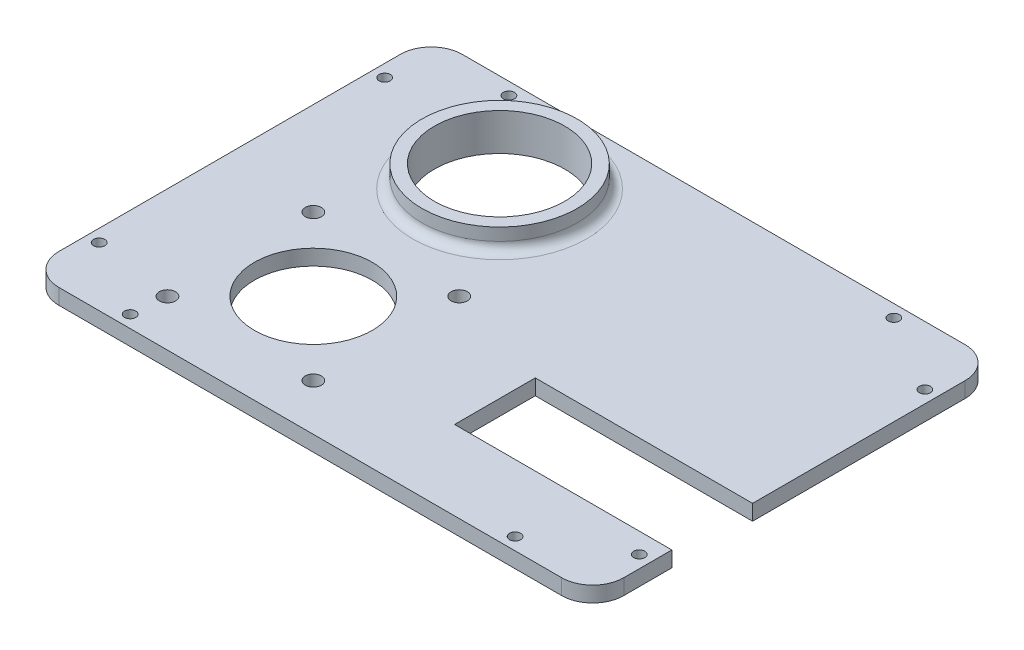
ISO-10303-21;
HEADER;
FILE_DESCRIPTION(('STEP AP214'),'2;1');
FILE_NAME('part.step','',(''),(''),'','','');
FILE_SCHEMA(('AUTOMOTIVE_DESIGN { 1 0 10303 214 1 1 1 1 }'));
ENDSEC;
DATA;
#1=APPLICATION_CONTEXT('core data for automotive mechanical design processes');
#2=APPLICATION_PROTOCOL_DEFINITION('international standard','automotive_design',2000,#1);
#3=PRODUCT_CONTEXT('',#1,'mechanical');
#4=PRODUCT('Part','Part','',(#3));
#5=PRODUCT_RELATED_PRODUCT_CATEGORY('part','',(#4));
#6=PRODUCT_DEFINITION_FORMATION('','',#4);
#7=PRODUCT_DEFINITION_CONTEXT('part definition',#1,'design');
#8=PRODUCT_DEFINITION('design','',#6,#7);
#9=PRODUCT_DEFINITION_SHAPE('','',#8);
#10=(LENGTH_UNIT() NAMED_UNIT(*) SI_UNIT(.MILLI.,.METRE.));
#11=(NAMED_UNIT(*) PLANE_ANGLE_UNIT() SI_UNIT($,.RADIAN.));
#12=(NAMED_UNIT(*) SI_UNIT($,.STERADIAN.) SOLID_ANGLE_UNIT());
#13=UNCERTAINTY_MEASURE_WITH_UNIT(LENGTH_MEASURE(1.E-05),#10,'distance_accuracy_value','');
#14=(GEOMETRIC_REPRESENTATION_CONTEXT(3) GLOBAL_UNCERTAINTY_ASSIGNED_CONTEXT((#13)) GLOBAL_UNIT_ASSIGNED_CONTEXT((#10,
#11,#12)) REPRESENTATION_CONTEXT('',''));
#15=CARTESIAN_POINT('',(0.,0.,0.));
#16=DIRECTION('',(0.,0.,1.));
#17=DIRECTION('',(1.,0.,0.));
#18=AXIS2_PLACEMENT_3D('',#15,#16,#17);
#19=CARTESIAN_POINT('',(0.,5.,0.));
#20=DIRECTION('',(0.,1.,0.));
#21=DIRECTION('',(0.,0.,1.));
#22=AXIS2_PLACEMENT_3D('',#19,#20,#21);
#23=PLANE('',#22);
#24=CARTESIAN_POINT('',(99.5000000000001,5.,34.5));
#25=DIRECTION('',(0.,1.,0.));
#26=DIRECTION('',(0.,0.,-1.));
#27=AXIS2_PLACEMENT_3D('',#24,#25,#26);
#28=CIRCLE('',#27,1.80000000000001);
#29=CARTESIAN_POINT('',(99.5000000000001,5.,32.7));
#30=VERTEX_POINT('',#29);
#31=EDGE_CURVE('E616',#30,#30,#28,.T.);
#32=ORIENTED_EDGE('',*,*,#31,.F.);
#33=EDGE_LOOP('',(#32));
#34=FACE_BOUND('',#33,.T.);
#35=CARTESIAN_POINT('',(-49.5,5.,-72.5));
#36=DIRECTION('',(0.,1.,0.));
#37=DIRECTION('',(0.,0.,-1.));
#38=AXIS2_PLACEMENT_3D('',#35,#36,#37);
#39=CIRCLE('',#38,1.8);
#40=CARTESIAN_POINT('',(-49.5,5.,-74.3));
#41=VERTEX_POINT('',#40);
#42=EDGE_CURVE('E622',#41,#41,#39,.T.);
#43=ORIENTED_EDGE('',*,*,#42,.F.);
#44=EDGE_LOOP('',(#43));
#45=FACE_BOUND('',#44,.T.);
#46=CARTESIAN_POINT('',(-24.5,5.,-87.5));
#47=DIRECTION('',(0.,1.,0.));
#48=DIRECTION('',(0.,0.,-1.));
#49=AXIS2_PLACEMENT_3D('',#46,#47,#48);
#50=CIRCLE('',#49,1.80000000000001);
#51=CARTESIAN_POINT('',(-24.5,5.,-89.3));
#52=VERTEX_POINT('',#51);
#53=EDGE_CURVE('E641',#52,#52,#50,.T.);
#54=ORIENTED_EDGE('',*,*,#53,.F.);
#55=EDGE_LOOP('',(#54));
#56=FACE_BOUND('',#55,.T.);
#57=CARTESIAN_POINT('',(-24.5,5.,34.5));
#58=DIRECTION('',(0.,1.,0.));
#59=DIRECTION('',(0.,0.,1.));
#60=AXIS2_PLACEMENT_3D('',#57,#58,#59);
#61=CIRCLE('',#60,1.80000000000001);
#62=CARTESIAN_POINT('',(-24.5,5.,36.3));
#63=VERTEX_POINT('',#62);
#64=EDGE_CURVE('E633',#63,#63,#61,.T.);
#65=ORIENTED_EDGE('',*,*,#64,.F.);
#66=EDGE_LOOP('',(#65));
#67=FACE_BOUND('',#66,.T.);
#68=CARTESIAN_POINT('',(124.5,5.,19.5));
#69=DIRECTION('',(0.,1.,0.));
#70=DIRECTION('',(0.,0.,-1.));
#71=AXIS2_PLACEMENT_3D('',#68,#69,#70);
#72=CIRCLE('',#71,1.80000000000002);
#73=CARTESIAN_POINT('',(124.5,5.,17.7));
#74=VERTEX_POINT('',#73);
#75=EDGE_CURVE('E625',#74,#74,#72,.T.);
#76=ORIENTED_EDGE('',*,*,#75,.F.);
#77=EDGE_LOOP('',(#76));
#78=FACE_BOUND('',#77,.T.);
#79=CARTESIAN_POINT('',(124.5,5.,-72.5));
#80=DIRECTION('',(0.,1.,0.));
#81=DIRECTION('',(0.,0.,1.));
#82=AXIS2_PLACEMENT_3D('',#79,#80,#81);
#83=CIRCLE('',#82,1.80000000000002);
#84=CARTESIAN_POINT('',(124.5,5.,-70.7));
#85=VERTEX_POINT('',#84);
#86=EDGE_CURVE('E663',#85,#85,#83,.T.);
#87=ORIENTED_EDGE('',*,*,#86,.F.);
#88=EDGE_LOOP('',(#87));
#89=FACE_BOUND('',#88,.T.);
#90=CARTESIAN_POINT('',(99.5000000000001,5.,-87.5));
#91=DIRECTION('',(0.,1.,0.));
#92=DIRECTION('',(0.,0.,1.));
#93=AXIS2_PLACEMENT_3D('',#90,#91,#92);
#94=CIRCLE('',#93,1.80000000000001);
#95=CARTESIAN_POINT('',(99.5000000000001,5.,-85.7));
#96=VERTEX_POINT('',#95);
#97=EDGE_CURVE('E655',#96,#96,#94,.T.);
#98=ORIENTED_EDGE('',*,*,#97,.F.);
#99=EDGE_LOOP('',(#98));
#100=FACE_BOUND('',#99,.T.);
#101=CARTESIAN_POINT('',(-49.5,5.,19.5));
#102=DIRECTION('',(0.,1.,0.));
#103=DIRECTION('',(0.,0.,1.));
#104=AXIS2_PLACEMENT_3D('',#101,#102,#103);
#105=CIRCLE('',#104,1.8);
#106=CARTESIAN_POINT('',(-49.5,5.,21.3));
#107=VERTEX_POINT('',#106);
#108=EDGE_CURVE('E391',#107,#107,#105,.T.);
#109=ORIENTED_EDGE('',*,*,#108,.F.);
#110=EDGE_LOOP('',(#109));
#111=FACE_BOUND('',#110,.T.);
#112=CARTESIAN_POINT('',(0.,5.,-60.));
#113=DIRECTION('',(0.,1.,0.));
#114=DIRECTION('',(0.,0.,1.));
#115=AXIS2_PLACEMENT_3D('',#112,#113,#114);
#116=CIRCLE('',#115,28.);
#117=CARTESIAN_POINT('',(0.,5.,-32.));
#118=VERTEX_POINT('',#117);
#119=EDGE_CURVE('E11',#118,#118,#116,.F.);
#120=ORIENTED_EDGE('',*,*,#119,.T.);
#121=EDGE_LOOP('',(#120));
#122=FACE_BOUND('',#121,.T.);
#123=CARTESIAN_POINT('',(-23.5,5.,-23.5));
#124=DIRECTION('',(0.,1.,0.));
#125=DIRECTION('',(0.,0.,1.));
#126=AXIS2_PLACEMENT_3D('',#123,#124,#125);
#127=CIRCLE('',#126,2.59999999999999);
#128=CARTESIAN_POINT('',(-23.5,5.,-20.9));
#129=VERTEX_POINT('',#128);
#130=EDGE_CURVE('E181',#129,#129,#127,.T.);
#131=ORIENTED_EDGE('',*,*,#130,.F.);
#132=EDGE_LOOP('',(#131));
#133=FACE_BOUND('',#132,.T.);
#134=CARTESIAN_POINT('',(23.5,5.,-23.5));
#135=DIRECTION('',(0.,1.,0.));
#136=DIRECTION('',(0.,0.,1.));
#137=AXIS2_PLACEMENT_3D('',#134,#135,#136);
#138=CIRCLE('',#137,2.59999999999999);
#139=CARTESIAN_POINT('',(23.5,5.,-20.9));
#140=VERTEX_POINT('',#139);
#141=EDGE_CURVE('E177',#140,#140,#138,.T.);
#142=ORIENTED_EDGE('',*,*,#141,.F.);
#143=EDGE_LOOP('',(#142));
#144=FACE_BOUND('',#143,.T.);
#145=CARTESIAN_POINT('',(23.5,5.,23.5));
#146=DIRECTION('',(0.,1.,0.));
#147=DIRECTION('',(0.,0.,1.));
#148=AXIS2_PLACEMENT_3D('',#145,#146,#147);
#149=CIRCLE('',#148,2.59999999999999);
#150=CARTESIAN_POINT('',(23.5,5.,26.1));
#151=VERTEX_POINT('',#150);
#152=EDGE_CURVE('E173',#151,#151,#149,.T.);
#153=ORIENTED_EDGE('',*,*,#152,.F.);
#154=EDGE_LOOP('',(#153));
#155=FACE_BOUND('',#154,.T.);
#156=CARTESIAN_POINT('',(-23.5,5.,23.5));
#157=DIRECTION('',(0.,1.,0.));
#158=DIRECTION('',(0.,0.,1.));
#159=AXIS2_PLACEMENT_3D('',#156,#157,#158);
#160=CIRCLE('',#159,2.59999999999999);
#161=CARTESIAN_POINT('',(-23.5,5.,26.1));
#162=VERTEX_POINT('',#161);
#163=EDGE_CURVE('E169',#162,#162,#160,.T.);
#164=ORIENTED_EDGE('',*,*,#163,.F.);
#165=EDGE_LOOP('',(#164));
#166=FACE_BOUND('',#165,.T.);
#167=CARTESIAN_POINT('',(0.,5.,0.));
#168=DIRECTION('',(0.,1.,0.));
#169=DIRECTION('',(0.,0.,1.));
#170=AXIS2_PLACEMENT_3D('',#167,#168,#169);
#171=CIRCLE('',#170,19.);
#172=CARTESIAN_POINT('',(0.,5.,19.));
#173=VERTEX_POINT('',#172);
#174=EDGE_CURVE('E162',#173,#173,#171,.T.);
#175=ORIENTED_EDGE('',*,*,#174,.F.);
#176=EDGE_LOOP('',(#175));
#177=FACE_BOUND('',#176,.T.);
#178=DIRECTION('',(0.,0.,1.));
#179=VECTOR('',#178,1.);
#180=CARTESIAN_POINT('',(-53.5,5.,0.));
#181=LINE('',#180,#179);
#182=CARTESIAN_POINT('',(-53.5,5.,-81.5));
#183=VERTEX_POINT('',#182);
#184=CARTESIAN_POINT('',(-53.5,5.,28.5));
#185=VERTEX_POINT('',#184);
#186=EDGE_CURVE('E249',#183,#185,#181,.T.);
#187=ORIENTED_EDGE('',*,*,#186,.T.);
#188=CARTESIAN_POINT('',(-43.5,5.,28.5));
#189=DIRECTION('',(0.,1.,0.));
#190=DIRECTION('',(0.,0.,1.));
#191=AXIS2_PLACEMENT_3D('',#188,#189,#190);
#192=CIRCLE('',#191,9.99999999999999);
#193=CARTESIAN_POINT('',(-43.5,5.,38.5));
#194=VERTEX_POINT('',#193);
#195=EDGE_CURVE('E111',#185,#194,#192,.T.);
#196=ORIENTED_EDGE('',*,*,#195,.T.);
#197=DIRECTION('',(1.,0.,0.));
#198=VECTOR('',#197,1.);
#199=CARTESIAN_POINT('',(0.,5.,38.5));
#200=LINE('',#199,#198);
#201=CARTESIAN_POINT('',(118.5,5.,38.5));
#202=VERTEX_POINT('',#201);
#203=EDGE_CURVE('E399',#194,#202,#200,.T.);
#204=ORIENTED_EDGE('',*,*,#203,.T.);
#205=CARTESIAN_POINT('',(118.5,5.,28.5));
#206=DIRECTION('',(0.,1.,0.));
#207=DIRECTION('',(0.,0.,1.));
#208=AXIS2_PLACEMENT_3D('',#205,#206,#207);
#209=CIRCLE('',#208,9.99999999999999);
#210=CARTESIAN_POINT('',(128.5,5.,28.5));
#211=VERTEX_POINT('',#210);
#212=EDGE_CURVE('E402',#202,#211,#209,.T.);
#213=ORIENTED_EDGE('',*,*,#212,.T.);
#214=DIRECTION('',(0.,0.,1.));
#215=VECTOR('',#214,1.);
#216=CARTESIAN_POINT('',(128.5,5.,0.));
#217=LINE('',#216,#215);
#218=CARTESIAN_POINT('',(128.5,5.,13.));
#219=VERTEX_POINT('',#218);
#220=EDGE_CURVE('E405',#219,#211,#217,.T.);
#221=ORIENTED_EDGE('',*,*,#220,.F.);
#222=DIRECTION('',(1.,0.,0.));
#223=VECTOR('',#222,1.);
#224=CARTESIAN_POINT('',(0.,5.,13.));
#225=LINE('',#224,#223);
#226=CARTESIAN_POINT('',(58.5,5.,13.));
#227=VERTEX_POINT('',#226);
#228=EDGE_CURVE('E409',#227,#219,#225,.T.);
#229=ORIENTED_EDGE('',*,*,#228,.F.);
#230=DIRECTION('',(0.,0.,1.));
#231=VECTOR('',#230,1.);
#232=CARTESIAN_POINT('',(58.5,5.,0.));
#233=LINE('',#232,#231);
#234=CARTESIAN_POINT('',(58.5,5.,-13.));
#235=VERTEX_POINT('',#234);
#236=EDGE_CURVE('E413',#235,#227,#233,.T.);
#237=ORIENTED_EDGE('',*,*,#236,.F.);
#238=DIRECTION('',(-1.,0.,0.));
#239=VECTOR('',#238,1.);
#240=CARTESIAN_POINT('',(0.,5.,-13.));
#241=LINE('',#240,#239);
#242=CARTESIAN_POINT('',(128.5,5.,-13.));
#243=VERTEX_POINT('',#242);
#244=EDGE_CURVE('E416',#243,#235,#241,.T.);
#245=ORIENTED_EDGE('',*,*,#244,.F.);
#246=CARTESIAN_POINT('',(128.5,5.,-81.5));
#247=VERTEX_POINT('',#246);
#248=EDGE_CURVE('E155',#247,#243,#217,.T.);
#249=ORIENTED_EDGE('',*,*,#248,.F.);
#250=CARTESIAN_POINT('',(118.5,5.,-81.5));
#251=DIRECTION('',(0.,1.,0.));
#252=DIRECTION('',(0.,0.,1.));
#253=AXIS2_PLACEMENT_3D('',#250,#251,#252);
#254=CIRCLE('',#253,9.99999999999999);
#255=CARTESIAN_POINT('',(118.5,5.,-91.5));
#256=VERTEX_POINT('',#255);
#257=EDGE_CURVE('E141',#256,#247,#254,.F.);
#258=ORIENTED_EDGE('',*,*,#257,.F.);
#259=DIRECTION('',(1.,0.,0.));
#260=VECTOR('',#259,1.);
#261=CARTESIAN_POINT('',(0.,5.,-91.5));
#262=LINE('',#261,#260);
#263=CARTESIAN_POINT('',(-43.5,5.,-91.5));
#264=VERTEX_POINT('',#263);
#265=EDGE_CURVE('E152',#264,#256,#262,.T.);
#266=ORIENTED_EDGE('',*,*,#265,.F.);
#267=CARTESIAN_POINT('',(-43.5,5.,-81.5));
#268=DIRECTION('',(0.,1.,0.));
#269=DIRECTION('',(0.,0.,1.));
#270=AXIS2_PLACEMENT_3D('',#267,#268,#269);
#271=CIRCLE('',#270,9.99999999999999);
#272=EDGE_CURVE('E59',#264,#183,#271,.T.);
#273=ORIENTED_EDGE('',*,*,#272,.T.);
#274=EDGE_LOOP('',(#187,#196,#204,#213,#221,#229,#237,#245,#249,#258,#266,#273));
#275=FACE_BOUND('',#274,.T.);
#276=ADVANCED_FACE('F41',(#34,#45,#56,#67,#78,#89,#100,#111,#122,#133,#144,#155,#166,#177,#275),
#23,.T.);
#277=CARTESIAN_POINT('',(-53.5,5.,0.));
#278=DIRECTION('',(1.,0.,0.));
#279=DIRECTION('',(0.,0.,-1.));
#280=AXIS2_PLACEMENT_3D('',#277,#278,#279);
#281=PLANE('',#280);
#282=DIRECTION('',(0.,0.,1.));
#283=VECTOR('',#282,1.);
#284=CARTESIAN_POINT('',(-53.5,0.,0.));
#285=LINE('',#284,#283);
#286=CARTESIAN_POINT('',(-53.5,0.,-81.5));
#287=VERTEX_POINT('',#286);
#288=CARTESIAN_POINT('',(-53.5,0.,28.5));
#289=VERTEX_POINT('',#288);
#290=EDGE_CURVE('E190',#287,#289,#285,.T.);
#291=ORIENTED_EDGE('',*,*,#290,.T.);
#292=DIRECTION('',(0.,-1.,0.));
#293=VECTOR('',#292,1.);
#294=CARTESIAN_POINT('',(-53.5,5.,28.5));
#295=LINE('',#294,#293);
#296=EDGE_CURVE('E279',#185,#289,#295,.T.);
#297=ORIENTED_EDGE('',*,*,#296,.F.);
#298=ORIENTED_EDGE('',*,*,#186,.F.);
#299=DIRECTION('',(0.,-1.,0.));
#300=VECTOR('',#299,1.);
#301=CARTESIAN_POINT('',(-53.5,5.,-81.5));
#302=LINE('',#301,#300);
#303=EDGE_CURVE('E185',#183,#287,#302,.T.);
#304=ORIENTED_EDGE('',*,*,#303,.T.);
#305=EDGE_LOOP('',(#291,#297,#298,#304));
#306=FACE_BOUND('',#305,.T.);
#307=ADVANCED_FACE('F302',(#306),#281,.F.);
#308=CARTESIAN_POINT('',(-43.5,5.,28.5));
#309=DIRECTION('',(0.,-1.,0.));
#310=DIRECTION('',(0.,0.,-1.));
#311=AXIS2_PLACEMENT_3D('',#308,#309,#310);
#312=CYLINDRICAL_SURFACE('',#311,9.99999999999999);
#313=CARTESIAN_POINT('',(-43.5,0.,28.5));
#314=DIRECTION('',(0.,1.,0.));
#315=DIRECTION('',(0.,0.,1.));
#316=AXIS2_PLACEMENT_3D('',#313,#314,#315);
#317=CIRCLE('',#316,9.99999999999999);
#318=CARTESIAN_POINT('',(-43.5,0.,38.5));
#319=VERTEX_POINT('',#318);
#320=EDGE_CURVE('E195',#289,#319,#317,.T.);
#321=ORIENTED_EDGE('',*,*,#320,.T.);
#322=DIRECTION('',(0.,-1.,0.));
#323=VECTOR('',#322,1.);
#324=CARTESIAN_POINT('',(-43.5,5.,38.5));
#325=LINE('',#324,#323);
#326=EDGE_CURVE('E275',#194,#319,#325,.T.);
#327=ORIENTED_EDGE('',*,*,#326,.F.);
#328=ORIENTED_EDGE('',*,*,#195,.F.);
#329=ORIENTED_EDGE('',*,*,#296,.T.);
#330=EDGE_LOOP('',(#321,#327,#328,#329));
#331=FACE_BOUND('',#330,.T.);
#332=ADVANCED_FACE('F308',(#331),#312,.T.);
#333=CARTESIAN_POINT('',(0.,5.,38.5));
#334=DIRECTION('',(0.,0.,-1.));
#335=DIRECTION('',(-1.,0.,0.));
#336=AXIS2_PLACEMENT_3D('',#333,#334,#335);
#337=PLANE('',#336);
#338=DIRECTION('',(1.,0.,0.));
#339=VECTOR('',#338,1.);
#340=CARTESIAN_POINT('',(0.,0.,38.5));
#341=LINE('',#340,#339);
#342=CARTESIAN_POINT('',(118.5,0.,38.5));
#343=VERTEX_POINT('',#342);
#344=EDGE_CURVE('E198',#319,#343,#341,.T.);
#345=ORIENTED_EDGE('',*,*,#344,.T.);
#346=DIRECTION('',(0.,-1.,0.));
#347=VECTOR('',#346,1.);
#348=CARTESIAN_POINT('',(118.5,5.,38.5));
#349=LINE('',#348,#347);
#350=EDGE_CURVE('E271',#202,#343,#349,.T.);
#351=ORIENTED_EDGE('',*,*,#350,.F.);
#352=ORIENTED_EDGE('',*,*,#203,.F.);
#353=ORIENTED_EDGE('',*,*,#326,.T.);
#354=EDGE_LOOP('',(#345,#351,#352,#353));
#355=FACE_BOUND('',#354,.T.);
#356=ADVANCED_FACE('F367',(#355),#337,.F.);
#357=CARTESIAN_POINT('',(118.5,5.,28.5));
#358=DIRECTION('',(0.,-1.,0.));
#359=DIRECTION('',(0.,0.,-1.));
#360=AXIS2_PLACEMENT_3D('',#357,#358,#359);
#361=CYLINDRICAL_SURFACE('',#360,9.99999999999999);
#362=CARTESIAN_POINT('',(118.5,0.,28.5));
#363=DIRECTION('',(0.,1.,0.));
#364=DIRECTION('',(0.,0.,1.));
#365=AXIS2_PLACEMENT_3D('',#362,#363,#364);
#366=CIRCLE('',#365,9.99999999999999);
#367=CARTESIAN_POINT('',(128.5,0.,28.5));
#368=VERTEX_POINT('',#367);
#369=EDGE_CURVE('E201',#343,#368,#366,.T.);
#370=ORIENTED_EDGE('',*,*,#369,.T.);
#371=DIRECTION('',(0.,-1.,0.));
#372=VECTOR('',#371,1.);
#373=CARTESIAN_POINT('',(128.5,5.,28.5));
#374=LINE('',#373,#372);
#375=EDGE_CURVE('E268',#211,#368,#374,.T.);
#376=ORIENTED_EDGE('',*,*,#375,.F.);
#377=ORIENTED_EDGE('',*,*,#212,.F.);
#378=ORIENTED_EDGE('',*,*,#350,.T.);
#379=EDGE_LOOP('',(#370,#376,#377,#378));
#380=FACE_BOUND('',#379,.T.);
#381=ADVANCED_FACE('F364',(#380),#361,.T.);
#382=CARTESIAN_POINT('',(128.5,5.,0.));
#383=DIRECTION('',(1.,0.,0.));
#384=DIRECTION('',(0.,0.,-1.));
#385=AXIS2_PLACEMENT_3D('',#382,#383,#384);
#386=PLANE('',#385);
#387=DIRECTION('',(0.,0.,1.));
#388=VECTOR('',#387,1.);
#389=CARTESIAN_POINT('',(128.5,0.,0.));
#390=LINE('',#389,#388);
#391=CARTESIAN_POINT('',(128.5,0.,13.));
#392=VERTEX_POINT('',#391);
#393=EDGE_CURVE('E205',#392,#368,#390,.T.);
#394=ORIENTED_EDGE('',*,*,#393,.F.);
#395=DIRECTION('',(0.,-1.,0.));
#396=VECTOR('',#395,1.);
#397=CARTESIAN_POINT('',(128.5,5.,13.));
#398=LINE('',#397,#396);
#399=EDGE_CURVE('E265',#219,#392,#398,.T.);
#400=ORIENTED_EDGE('',*,*,#399,.F.);
#401=ORIENTED_EDGE('',*,*,#220,.T.);
#402=ORIENTED_EDGE('',*,*,#375,.T.);
#403=EDGE_LOOP('',(#394,#400,#401,#402));
#404=FACE_BOUND('',#403,.T.);
#405=ADVANCED_FACE('F352',(#404),#386,.T.);
#406=CARTESIAN_POINT('',(0.,5.,13.));
#407=DIRECTION('',(0.,0.,-1.));
#408=DIRECTION('',(-1.,0.,0.));
#409=AXIS2_PLACEMENT_3D('',#406,#407,#408);
#410=PLANE('',#409);
#411=DIRECTION('',(1.,0.,0.));
#412=VECTOR('',#411,1.);
#413=CARTESIAN_POINT('',(0.,0.,13.));
#414=LINE('',#413,#412);
#415=CARTESIAN_POINT('',(58.5,0.,13.));
#416=VERTEX_POINT('',#415);
#417=EDGE_CURVE('E209',#416,#392,#414,.T.);
#418=ORIENTED_EDGE('',*,*,#417,.F.);
#419=DIRECTION('',(0.,-1.,0.));
#420=VECTOR('',#419,1.);
#421=CARTESIAN_POINT('',(58.5,5.,13.));
#422=LINE('',#421,#420);
#423=EDGE_CURVE('E262',#227,#416,#422,.T.);
#424=ORIENTED_EDGE('',*,*,#423,.F.);
#425=ORIENTED_EDGE('',*,*,#228,.T.);
#426=ORIENTED_EDGE('',*,*,#399,.T.);
#427=EDGE_LOOP('',(#418,#424,#425,#426));
#428=FACE_BOUND('',#427,.T.);
#429=ADVANCED_FACE('F359',(#428),#410,.T.);
#430=CARTESIAN_POINT('',(58.5,5.,0.));
#431=DIRECTION('',(1.,0.,0.));
#432=DIRECTION('',(0.,0.,-1.));
#433=AXIS2_PLACEMENT_3D('',#430,#431,#432);
#434=PLANE('',#433);
#435=DIRECTION('',(0.,0.,1.));
#436=VECTOR('',#435,1.);
#437=CARTESIAN_POINT('',(58.5,0.,0.));
#438=LINE('',#437,#436);
#439=CARTESIAN_POINT('',(58.5,0.,-13.));
#440=VERTEX_POINT('',#439);
#441=EDGE_CURVE('E214',#440,#416,#438,.T.);
#442=ORIENTED_EDGE('',*,*,#441,.F.);
#443=DIRECTION('',(0.,-1.,0.));
#444=VECTOR('',#443,1.);
#445=CARTESIAN_POINT('',(58.5,5.,-13.));
#446=LINE('',#445,#444);
#447=EDGE_CURVE('E259',#235,#440,#446,.T.);
#448=ORIENTED_EDGE('',*,*,#447,.F.);
#449=ORIENTED_EDGE('',*,*,#236,.T.);
#450=ORIENTED_EDGE('',*,*,#423,.T.);
#451=EDGE_LOOP('',(#442,#448,#449,#450));
#452=FACE_BOUND('',#451,.T.);
#453=ADVANCED_FACE('F355',(#452),#434,.T.);
#454=CARTESIAN_POINT('',(0.,5.,-13.));
#455=DIRECTION('',(0.,0.,1.));
#456=DIRECTION('',(1.,0.,0.));
#457=AXIS2_PLACEMENT_3D('',#454,#455,#456);
#458=PLANE('',#457);
#459=DIRECTION('',(-1.,0.,0.));
#460=VECTOR('',#459,1.);
#461=CARTESIAN_POINT('',(0.,0.,-13.));
#462=LINE('',#461,#460);
#463=CARTESIAN_POINT('',(128.5,0.,-13.));
#464=VERTEX_POINT('',#463);
#465=EDGE_CURVE('E218',#464,#440,#462,.T.);
#466=ORIENTED_EDGE('',*,*,#465,.F.);
#467=DIRECTION('',(0.,-1.,0.));
#468=VECTOR('',#467,1.);
#469=CARTESIAN_POINT('',(128.5,5.,-13.));
#470=LINE('',#469,#468);
#471=EDGE_CURVE('E256',#243,#464,#470,.T.);
#472=ORIENTED_EDGE('',*,*,#471,.F.);
#473=ORIENTED_EDGE('',*,*,#244,.T.);
#474=ORIENTED_EDGE('',*,*,#447,.T.);
#475=EDGE_LOOP('',(#466,#472,#473,#474));
#476=FACE_BOUND('',#475,.T.);
#477=ADVANCED_FACE('F350',(#476),#458,.T.);
#478=CARTESIAN_POINT('',(128.5,0.,-81.5));
#479=VERTEX_POINT('',#478);
#480=EDGE_CURVE('E210',#479,#464,#390,.T.);
#481=ORIENTED_EDGE('',*,*,#480,.F.);
#482=DIRECTION('',(0.,-1.,0.));
#483=VECTOR('',#482,1.);
#484=CARTESIAN_POINT('',(128.5,5.,-81.5));
#485=LINE('',#484,#483);
#486=EDGE_CURVE('E149',#247,#479,#485,.T.);
#487=ORIENTED_EDGE('',*,*,#486,.F.);
#488=ORIENTED_EDGE('',*,*,#248,.T.);
#489=ORIENTED_EDGE('',*,*,#471,.T.);
#490=EDGE_LOOP('',(#481,#487,#488,#489));
#491=FACE_BOUND('',#490,.T.);
#492=ADVANCED_FACE('F347',(#491),#386,.T.);
#493=CARTESIAN_POINT('',(118.5,5.,-81.5));
#494=DIRECTION('',(0.,-1.,0.));
#495=DIRECTION('',(0.,0.,-1.));
#496=AXIS2_PLACEMENT_3D('',#493,#494,#495);
#497=CYLINDRICAL_SURFACE('',#496,9.99999999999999);
#498=CARTESIAN_POINT('',(118.5,0.,-81.5));
#499=DIRECTION('',(0.,1.,0.));
#500=DIRECTION('',(0.,0.,1.));
#501=AXIS2_PLACEMENT_3D('',#498,#499,#500);
#502=CIRCLE('',#501,9.99999999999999);
#503=CARTESIAN_POINT('',(118.5,0.,-91.5));
#504=VERTEX_POINT('',#503);
#505=EDGE_CURVE('E143',#504,#479,#502,.F.);
#506=ORIENTED_EDGE('',*,*,#505,.F.);
#507=DIRECTION('',(0.,-1.,0.));
#508=VECTOR('',#507,1.);
#509=CARTESIAN_POINT('',(118.5,5.,-91.5));
#510=LINE('',#509,#508);
#511=EDGE_CURVE('E138',#256,#504,#510,.T.);
#512=ORIENTED_EDGE('',*,*,#511,.F.);
#513=ORIENTED_EDGE('',*,*,#257,.T.);
#514=ORIENTED_EDGE('',*,*,#486,.T.);
#515=EDGE_LOOP('',(#506,#512,#513,#514));
#516=FACE_BOUND('',#515,.T.);
#517=ADVANCED_FACE('F140',(#516),#497,.T.);
#518=CARTESIAN_POINT('',(0.,5.,-91.5));
#519=DIRECTION('',(0.,0.,-1.));
#520=DIRECTION('',(-1.,0.,0.));
#521=AXIS2_PLACEMENT_3D('',#518,#519,#520);
#522=PLANE('',#521);
#523=DIRECTION('',(1.,0.,0.));
#524=VECTOR('',#523,1.);
#525=CARTESIAN_POINT('',(0.,0.,-91.5));
#526=LINE('',#525,#524);
#527=CARTESIAN_POINT('',(-43.5,0.,-91.5));
#528=VERTEX_POINT('',#527);
#529=EDGE_CURVE('E224',#528,#504,#526,.T.);
#530=ORIENTED_EDGE('',*,*,#529,.F.);
#531=DIRECTION('',(0.,-1.,0.));
#532=VECTOR('',#531,1.);
#533=CARTESIAN_POINT('',(-43.5,5.,-91.5));
#534=LINE('',#533,#532);
#535=EDGE_CURVE('E99',#264,#528,#534,.T.);
#536=ORIENTED_EDGE('',*,*,#535,.F.);
#537=ORIENTED_EDGE('',*,*,#265,.T.);
#538=ORIENTED_EDGE('',*,*,#511,.T.);
#539=EDGE_LOOP('',(#530,#536,#537,#538));
#540=FACE_BOUND('',#539,.T.);
#541=ADVANCED_FACE('F158',(#540),#522,.T.);
#542=CARTESIAN_POINT('',(23.5,5.,-23.5));
#543=DIRECTION('',(0.,-1.,0.));
#544=DIRECTION('',(0.,0.,-1.));
#545=AXIS2_PLACEMENT_3D('',#542,#543,#544);
#546=CYLINDRICAL_SURFACE('',#545,2.59999999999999);
#547=ORIENTED_EDGE('',*,*,#141,.T.);
#548=EDGE_LOOP('',(#547));
#549=FACE_BOUND('',#548,.T.);
#550=CARTESIAN_POINT('',(23.5,0.,-23.5));
#551=DIRECTION('',(0.,1.,0.));
#552=DIRECTION('',(0.,0.,1.));
#553=AXIS2_PLACEMENT_3D('',#550,#551,#552);
#554=CIRCLE('',#553,2.59999999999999);
#555=CARTESIAN_POINT('',(23.5,0.,-20.9));
#556=VERTEX_POINT('',#555);
#557=EDGE_CURVE('E241',#556,#556,#554,.T.);
#558=ORIENTED_EDGE('',*,*,#557,.F.);
#559=EDGE_LOOP('',(#558));
#560=FACE_BOUND('',#559,.T.);
#561=ADVANCED_FACE('F324',(#549,#560),#546,.F.);
#562=CARTESIAN_POINT('',(23.5,5.,23.5));
#563=DIRECTION('',(0.,-1.,0.));
#564=DIRECTION('',(0.,0.,-1.));
#565=AXIS2_PLACEMENT_3D('',#562,#563,#564);
#566=CYLINDRICAL_SURFACE('',#565,2.59999999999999);
#567=ORIENTED_EDGE('',*,*,#152,.T.);
#568=EDGE_LOOP('',(#567));
#569=FACE_BOUND('',#568,.T.);
#570=CARTESIAN_POINT('',(23.5,0.,23.5));
#571=DIRECTION('',(0.,1.,0.));
#572=DIRECTION('',(0.,0.,1.));
#573=AXIS2_PLACEMENT_3D('',#570,#571,#572);
#574=CIRCLE('',#573,2.59999999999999);
#575=CARTESIAN_POINT('',(23.5,0.,26.1));
#576=VERTEX_POINT('',#575);
#577=EDGE_CURVE('E237',#576,#576,#574,.T.);
#578=ORIENTED_EDGE('',*,*,#577,.F.);
#579=EDGE_LOOP('',(#578));
#580=FACE_BOUND('',#579,.T.);
#581=ADVANCED_FACE('F327',(#569,#580),#566,.F.);
#582=CARTESIAN_POINT('',(-23.5,5.,23.5));
#583=DIRECTION('',(0.,-1.,0.));
#584=DIRECTION('',(0.,0.,-1.));
#585=AXIS2_PLACEMENT_3D('',#582,#583,#584);
#586=CYLINDRICAL_SURFACE('',#585,2.59999999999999);
#587=ORIENTED_EDGE('',*,*,#163,.T.);
#588=EDGE_LOOP('',(#587));
#589=FACE_BOUND('',#588,.T.);
#590=CARTESIAN_POINT('',(-23.5,0.,23.5));
#591=DIRECTION('',(0.,1.,0.));
#592=DIRECTION('',(0.,0.,1.));
#593=AXIS2_PLACEMENT_3D('',#590,#591,#592);
#594=CIRCLE('',#593,2.59999999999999);
#595=CARTESIAN_POINT('',(-23.5,0.,26.1));
#596=VERTEX_POINT('',#595);
#597=EDGE_CURVE('E233',#596,#596,#594,.T.);
#598=ORIENTED_EDGE('',*,*,#597,.F.);
#599=EDGE_LOOP('',(#598));
#600=FACE_BOUND('',#599,.T.);
#601=ADVANCED_FACE('F331',(#589,#600),#586,.F.);
#602=CARTESIAN_POINT('',(0.,5.,0.));
#603=DIRECTION('',(0.,-1.,0.));
#604=DIRECTION('',(0.,0.,-1.));
#605=AXIS2_PLACEMENT_3D('',#602,#603,#604);
#606=CYLINDRICAL_SURFACE('',#605,19.);
#607=ORIENTED_EDGE('',*,*,#174,.T.);
#608=EDGE_LOOP('',(#607));
#609=FACE_BOUND('',#608,.T.);
#610=CARTESIAN_POINT('',(0.,0.,0.));
#611=DIRECTION('',(0.,1.,0.));
#612=DIRECTION('',(0.,0.,1.));
#613=AXIS2_PLACEMENT_3D('',#610,#611,#612);
#614=CIRCLE('',#613,19.);
#615=CARTESIAN_POINT('',(0.,0.,19.));
#616=VERTEX_POINT('',#615);
#617=EDGE_CURVE('E229',#616,#616,#614,.T.);
#618=ORIENTED_EDGE('',*,*,#617,.F.);
#619=EDGE_LOOP('',(#618));
#620=FACE_BOUND('',#619,.T.);
#621=ADVANCED_FACE('F335',(#609,#620),#606,.F.);
#622=CARTESIAN_POINT('',(-43.5,5.,-81.5));
#623=DIRECTION('',(0.,-1.,0.));
#624=DIRECTION('',(0.,0.,-1.));
#625=AXIS2_PLACEMENT_3D('',#622,#623,#624);
#626=CYLINDRICAL_SURFACE('',#625,9.99999999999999);
#627=CARTESIAN_POINT('',(-43.5,0.,-81.5));
#628=DIRECTION('',(0.,1.,0.));
#629=DIRECTION('',(0.,0.,1.));
#630=AXIS2_PLACEMENT_3D('',#627,#628,#629);
#631=CIRCLE('',#630,9.99999999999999);
#632=EDGE_CURVE('E102',#528,#287,#631,.T.);
#633=ORIENTED_EDGE('',*,*,#632,.T.);
#634=ORIENTED_EDGE('',*,*,#303,.F.);
#635=ORIENTED_EDGE('',*,*,#272,.F.);
#636=ORIENTED_EDGE('',*,*,#535,.T.);
#637=EDGE_LOOP('',(#633,#634,#635,#636));
#638=FACE_BOUND('',#637,.T.);
#639=ADVANCED_FACE('F339',(#638),#626,.T.);
#640=CARTESIAN_POINT('',(0.,5.,-60.));
#641=DIRECTION('',(0.,-1.,0.));
#642=DIRECTION('',(0.,0.,-1.));
#643=AXIS2_PLACEMENT_3D('',#640,#641,#642);
#644=CYLINDRICAL_SURFACE('',#643,21.);
#645=CARTESIAN_POINT('',(0.,0.,-60.));
#646=DIRECTION('',(0.,1.,0.));
#647=DIRECTION('',(0.,0.,1.));
#648=AXIS2_PLACEMENT_3D('',#645,#646,#647);
#649=CIRCLE('',#648,21.);
#650=CARTESIAN_POINT('',(0.,0.,-39.));
#651=VERTEX_POINT('',#650);
#652=EDGE_CURVE('E186',#651,#651,#649,.T.);
#653=ORIENTED_EDGE('',*,*,#652,.F.);
#654=EDGE_LOOP('',(#653));
#655=FACE_BOUND('',#654,.T.);
#656=CARTESIAN_POINT('',(0.,12.,-60.));
#657=DIRECTION('',(0.,1.,0.));
#658=DIRECTION('',(0.,0.,1.));
#659=AXIS2_PLACEMENT_3D('',#656,#657,#658);
#660=CIRCLE('',#659,21.);
#661=CARTESIAN_POINT('',(0.,12.,-39.));
#662=VERTEX_POINT('',#661);
#663=EDGE_CURVE('E381',#662,#662,#660,.T.);
#664=ORIENTED_EDGE('',*,*,#663,.T.);
#665=EDGE_LOOP('',(#664));
#666=FACE_BOUND('',#665,.T.);
#667=ADVANCED_FACE('F322',(#655,#666),#644,.F.);
#668=CARTESIAN_POINT('',(-23.5,5.,-23.5));
#669=DIRECTION('',(0.,-1.,0.));
#670=DIRECTION('',(0.,0.,-1.));
#671=AXIS2_PLACEMENT_3D('',#668,#669,#670);
#672=CYLINDRICAL_SURFACE('',#671,2.59999999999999);
#673=ORIENTED_EDGE('',*,*,#130,.T.);
#674=EDGE_LOOP('',(#673));
#675=FACE_BOUND('',#674,.T.);
#676=CARTESIAN_POINT('',(-23.5,0.,-23.5));
#677=DIRECTION('',(0.,1.,0.));
#678=DIRECTION('',(0.,0.,1.));
#679=AXIS2_PLACEMENT_3D('',#676,#677,#678);
#680=CIRCLE('',#679,2.59999999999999);
#681=CARTESIAN_POINT('',(-23.5,0.,-20.9));
#682=VERTEX_POINT('',#681);
#683=EDGE_CURVE('E245',#682,#682,#680,.T.);
#684=ORIENTED_EDGE('',*,*,#683,.F.);
#685=EDGE_LOOP('',(#684));
#686=FACE_BOUND('',#685,.T.);
#687=ADVANCED_FACE('F318',(#675,#686),#672,.F.);
#688=CARTESIAN_POINT('',(0.,0.,0.));
#689=DIRECTION('',(0.,1.,0.));
#690=DIRECTION('',(0.,0.,1.));
#691=AXIS2_PLACEMENT_3D('',#688,#689,#690);
#692=PLANE('',#691);
#693=CARTESIAN_POINT('',(99.5000000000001,0.,34.5));
#694=DIRECTION('',(0.,1.,0.));
#695=DIRECTION('',(0.,0.,-1.));
#696=AXIS2_PLACEMENT_3D('',#693,#694,#695);
#697=CIRCLE('',#696,1.80000000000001);
#698=CARTESIAN_POINT('',(99.5000000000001,0.,32.7));
#699=VERTEX_POINT('',#698);
#700=EDGE_CURVE('E614',#699,#699,#697,.T.);
#701=ORIENTED_EDGE('',*,*,#700,.T.);
#702=EDGE_LOOP('',(#701));
#703=FACE_BOUND('',#702,.T.);
#704=CARTESIAN_POINT('',(-49.5,0.,-72.5));
#705=DIRECTION('',(0.,1.,0.));
#706=DIRECTION('',(0.,0.,-1.));
#707=AXIS2_PLACEMENT_3D('',#704,#705,#706);
#708=CIRCLE('',#707,1.8);
#709=CARTESIAN_POINT('',(-49.5,0.,-74.3));
#710=VERTEX_POINT('',#709);
#711=EDGE_CURVE('E644',#710,#710,#708,.T.);
#712=ORIENTED_EDGE('',*,*,#711,.T.);
#713=EDGE_LOOP('',(#712));
#714=FACE_BOUND('',#713,.T.);
#715=CARTESIAN_POINT('',(-24.5,0.,-87.5));
#716=DIRECTION('',(0.,1.,0.));
#717=DIRECTION('',(0.,0.,-1.));
#718=AXIS2_PLACEMENT_3D('',#715,#716,#717);
#719=CIRCLE('',#718,1.80000000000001);
#720=CARTESIAN_POINT('',(-24.5,0.,-89.3));
#721=VERTEX_POINT('',#720);
#722=EDGE_CURVE('E637',#721,#721,#719,.T.);
#723=ORIENTED_EDGE('',*,*,#722,.T.);
#724=EDGE_LOOP('',(#723));
#725=FACE_BOUND('',#724,.T.);
#726=CARTESIAN_POINT('',(-24.5,0.,34.5));
#727=DIRECTION('',(0.,1.,0.));
#728=DIRECTION('',(0.,0.,1.));
#729=AXIS2_PLACEMENT_3D('',#726,#727,#728);
#730=CIRCLE('',#729,1.80000000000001);
#731=CARTESIAN_POINT('',(-24.5,0.,36.3));
#732=VERTEX_POINT('',#731);
#733=EDGE_CURVE('E629',#732,#732,#730,.T.);
#734=ORIENTED_EDGE('',*,*,#733,.T.);
#735=EDGE_LOOP('',(#734));
#736=FACE_BOUND('',#735,.T.);
#737=CARTESIAN_POINT('',(124.5,0.,19.5));
#738=DIRECTION('',(0.,1.,0.));
#739=DIRECTION('',(0.,0.,-1.));
#740=AXIS2_PLACEMENT_3D('',#737,#738,#739);
#741=CIRCLE('',#740,1.80000000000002);
#742=CARTESIAN_POINT('',(124.5,0.,17.7));
#743=VERTEX_POINT('',#742);
#744=EDGE_CURVE('E618',#743,#743,#741,.T.);
#745=ORIENTED_EDGE('',*,*,#744,.T.);
#746=EDGE_LOOP('',(#745));
#747=FACE_BOUND('',#746,.T.);
#748=CARTESIAN_POINT('',(124.5,0.,-72.5));
#749=DIRECTION('',(0.,1.,0.));
#750=DIRECTION('',(0.,0.,1.));
#751=AXIS2_PLACEMENT_3D('',#748,#749,#750);
#752=CIRCLE('',#751,1.80000000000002);
#753=CARTESIAN_POINT('',(124.5,0.,-70.7));
#754=VERTEX_POINT('',#753);
#755=EDGE_CURVE('E667',#754,#754,#752,.T.);
#756=ORIENTED_EDGE('',*,*,#755,.T.);
#757=EDGE_LOOP('',(#756));
#758=FACE_BOUND('',#757,.T.);
#759=CARTESIAN_POINT('',(99.5000000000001,0.,-87.5));
#760=DIRECTION('',(0.,1.,0.));
#761=DIRECTION('',(0.,0.,1.));
#762=AXIS2_PLACEMENT_3D('',#759,#760,#761);
#763=CIRCLE('',#762,1.80000000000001);
#764=CARTESIAN_POINT('',(99.5000000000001,0.,-85.7));
#765=VERTEX_POINT('',#764);
#766=EDGE_CURVE('E659',#765,#765,#763,.T.);
#767=ORIENTED_EDGE('',*,*,#766,.T.);
#768=EDGE_LOOP('',(#767));
#769=FACE_BOUND('',#768,.T.);
#770=CARTESIAN_POINT('',(-49.5,0.,19.5));
#771=DIRECTION('',(0.,1.,0.));
#772=DIRECTION('',(0.,0.,1.));
#773=AXIS2_PLACEMENT_3D('',#770,#771,#772);
#774=CIRCLE('',#773,1.8);
#775=CARTESIAN_POINT('',(-49.5,0.,21.3));
#776=VERTEX_POINT('',#775);
#777=EDGE_CURVE('E384',#776,#776,#774,.T.);
#778=ORIENTED_EDGE('',*,*,#777,.T.);
#779=EDGE_LOOP('',(#778));
#780=FACE_BOUND('',#779,.T.);
#781=ORIENTED_EDGE('',*,*,#652,.T.);
#782=EDGE_LOOP('',(#781));
#783=FACE_BOUND('',#782,.T.);
#784=ORIENTED_EDGE('',*,*,#290,.F.);
#785=ORIENTED_EDGE('',*,*,#632,.F.);
#786=ORIENTED_EDGE('',*,*,#529,.T.);
#787=ORIENTED_EDGE('',*,*,#505,.T.);
#788=ORIENTED_EDGE('',*,*,#480,.T.);
#789=ORIENTED_EDGE('',*,*,#465,.T.);
#790=ORIENTED_EDGE('',*,*,#441,.T.);
#791=ORIENTED_EDGE('',*,*,#417,.T.);
#792=ORIENTED_EDGE('',*,*,#393,.T.);
#793=ORIENTED_EDGE('',*,*,#369,.F.);
#794=ORIENTED_EDGE('',*,*,#344,.F.);
#795=ORIENTED_EDGE('',*,*,#320,.F.);
#796=EDGE_LOOP('',(#784,#785,#786,#787,#788,#789,#790,#791,#792,#793,#794,#795));
#797=FACE_BOUND('',#796,.T.);
#798=ORIENTED_EDGE('',*,*,#617,.T.);
#799=EDGE_LOOP('',(#798));
#800=FACE_BOUND('',#799,.T.);
#801=ORIENTED_EDGE('',*,*,#597,.T.);
#802=EDGE_LOOP('',(#801));
#803=FACE_BOUND('',#802,.T.);
#804=ORIENTED_EDGE('',*,*,#577,.T.);
#805=EDGE_LOOP('',(#804));
#806=FACE_BOUND('',#805,.T.);
#807=ORIENTED_EDGE('',*,*,#557,.T.);
#808=EDGE_LOOP('',(#807));
#809=FACE_BOUND('',#808,.T.);
#810=ORIENTED_EDGE('',*,*,#683,.T.);
#811=EDGE_LOOP('',(#810));
#812=FACE_BOUND('',#811,.T.);
#813=ADVANCED_FACE('F315',(#703,#714,#725,#736,#747,#758,#769,#780,#783,#797,#800,#803,#806,
#809,#812),#692,.F.);
#814=CARTESIAN_POINT('',(0.,12.,-60.));
#815=DIRECTION('',(0.,1.,0.));
#816=DIRECTION('',(0.,0.,1.));
#817=AXIS2_PLACEMENT_3D('',#814,#815,#816);
#818=PLANE('',#817);
#819=CARTESIAN_POINT('',(0.,12.,-60.));
#820=DIRECTION('',(0.,1.,0.));
#821=DIRECTION('',(0.,0.,1.));
#822=AXIS2_PLACEMENT_3D('',#819,#820,#821);
#823=CIRCLE('',#822,25.);
#824=CARTESIAN_POINT('',(0.,12.,-35.));
#825=VERTEX_POINT('',#824);
#826=EDGE_CURVE('E191',#825,#825,#823,.T.);
#827=ORIENTED_EDGE('',*,*,#826,.T.);
#828=EDGE_LOOP('',(#827));
#829=FACE_BOUND('',#828,.T.);
#830=ORIENTED_EDGE('',*,*,#663,.F.);
#831=EDGE_LOOP('',(#830));
#832=FACE_BOUND('',#831,.T.);
#833=ADVANCED_FACE('F298',(#829,#832),#818,.T.);
#834=CARTESIAN_POINT('',(0.,12.,-60.));
#835=DIRECTION('',(0.,-1.,0.));
#836=DIRECTION('',(0.,0.,-1.));
#837=AXIS2_PLACEMENT_3D('',#834,#835,#836);
#838=CYLINDRICAL_SURFACE('',#837,25.);
#839=CARTESIAN_POINT('',(0.,8.,-60.));
#840=DIRECTION('',(0.,1.,0.));
#841=DIRECTION('',(0.,0.,1.));
#842=AXIS2_PLACEMENT_3D('',#839,#840,#841);
#843=CIRCLE('',#842,25.);
#844=CARTESIAN_POINT('',(0.,8.,-35.));
#845=VERTEX_POINT('',#844);
#846=EDGE_CURVE('E51',#845,#845,#843,.T.);
#847=ORIENTED_EDGE('',*,*,#846,.T.);
#848=EDGE_LOOP('',(#847));
#849=FACE_BOUND('',#848,.T.);
#850=ORIENTED_EDGE('',*,*,#826,.F.);
#851=EDGE_LOOP('',(#850));
#852=FACE_BOUND('',#851,.T.);
#853=ADVANCED_FACE('F285',(#849,#852),#838,.T.);
#854=CARTESIAN_POINT('',(0.,8.,-60.));
#855=DIRECTION('',(0.,1.,0.));
#856=DIRECTION('',(0.,0.,1.));
#857=AXIS2_PLACEMENT_3D('',#854,#855,#856);
#858=TOROIDAL_SURFACE('',#857,28.,3.);
#859=ORIENTED_EDGE('',*,*,#119,.F.);
#860=EDGE_LOOP('',(#859));
#861=FACE_BOUND('',#860,.T.);
#862=ORIENTED_EDGE('',*,*,#846,.F.);
#863=EDGE_LOOP('',(#862));
#864=FACE_BOUND('',#863,.T.);
#865=ADVANCED_FACE('F43',(#861,#864),#858,.F.);
#866=CARTESIAN_POINT('',(-49.5,0.,19.5));
#867=DIRECTION('',(0.,1.,0.));
#868=DIRECTION('',(0.,0.,1.));
#869=AXIS2_PLACEMENT_3D('',#866,#867,#868);
#870=CYLINDRICAL_SURFACE('',#869,1.8);
#871=ORIENTED_EDGE('',*,*,#777,.F.);
#872=EDGE_LOOP('',(#871));
#873=FACE_BOUND('',#872,.T.);
#874=ORIENTED_EDGE('',*,*,#108,.T.);
#875=EDGE_LOOP('',(#874));
#876=FACE_BOUND('',#875,.T.);
#877=ADVANCED_FACE('F289',(#873,#876),#870,.F.);
#878=CARTESIAN_POINT('',(99.5000000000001,0.,-87.5));
#879=DIRECTION('',(0.,1.,0.));
#880=DIRECTION('',(0.,0.,1.));
#881=AXIS2_PLACEMENT_3D('',#878,#879,#880);
#882=CYLINDRICAL_SURFACE('',#881,1.80000000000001);
#883=ORIENTED_EDGE('',*,*,#766,.F.);
#884=EDGE_LOOP('',(#883));
#885=FACE_BOUND('',#884,.T.);
#886=ORIENTED_EDGE('',*,*,#97,.T.);
#887=EDGE_LOOP('',(#886));
#888=FACE_BOUND('',#887,.T.);
#889=ADVANCED_FACE('F295',(#885,#888),#882,.F.);
#890=CARTESIAN_POINT('',(124.5,0.,-72.5));
#891=DIRECTION('',(0.,1.,0.));
#892=DIRECTION('',(0.,0.,1.));
#893=AXIS2_PLACEMENT_3D('',#890,#891,#892);
#894=CYLINDRICAL_SURFACE('',#893,1.80000000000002);
#895=ORIENTED_EDGE('',*,*,#755,.F.);
#896=EDGE_LOOP('',(#895));
#897=FACE_BOUND('',#896,.T.);
#898=ORIENTED_EDGE('',*,*,#86,.T.);
#899=EDGE_LOOP('',(#898));
#900=FACE_BOUND('',#899,.T.);
#901=ADVANCED_FACE('F547',(#897,#900),#894,.F.);
#902=CARTESIAN_POINT('',(124.5,0.,19.5));
#903=DIRECTION('',(0.,1.,0.));
#904=DIRECTION('',(0.,0.,1.));
#905=AXIS2_PLACEMENT_3D('',#902,#903,#904);
#906=CYLINDRICAL_SURFACE('',#905,1.80000000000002);
#907=ORIENTED_EDGE('',*,*,#744,.F.);
#908=EDGE_LOOP('',(#907));
#909=FACE_BOUND('',#908,.T.);
#910=ORIENTED_EDGE('',*,*,#75,.T.);
#911=EDGE_LOOP('',(#910));
#912=FACE_BOUND('',#911,.T.);
#913=ADVANCED_FACE('F557',(#909,#912),#906,.F.);
#914=CARTESIAN_POINT('',(-24.5,0.,34.5));
#915=DIRECTION('',(0.,1.,0.));
#916=DIRECTION('',(0.,0.,1.));
#917=AXIS2_PLACEMENT_3D('',#914,#915,#916);
#918=CYLINDRICAL_SURFACE('',#917,1.80000000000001);
#919=ORIENTED_EDGE('',*,*,#733,.F.);
#920=EDGE_LOOP('',(#919));
#921=FACE_BOUND('',#920,.T.);
#922=ORIENTED_EDGE('',*,*,#64,.T.);
#923=EDGE_LOOP('',(#922));
#924=FACE_BOUND('',#923,.T.);
#925=ADVANCED_FACE('F567',(#921,#924),#918,.F.);
#926=CARTESIAN_POINT('',(-24.5,0.,-87.5));
#927=DIRECTION('',(0.,1.,0.));
#928=DIRECTION('',(0.,0.,1.));
#929=AXIS2_PLACEMENT_3D('',#926,#927,#928);
#930=CYLINDRICAL_SURFACE('',#929,1.80000000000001);
#931=ORIENTED_EDGE('',*,*,#722,.F.);
#932=EDGE_LOOP('',(#931));
#933=FACE_BOUND('',#932,.T.);
#934=ORIENTED_EDGE('',*,*,#53,.T.);
#935=EDGE_LOOP('',(#934));
#936=FACE_BOUND('',#935,.T.);
#937=ADVANCED_FACE('F577',(#933,#936),#930,.F.);
#938=CARTESIAN_POINT('',(-49.5,0.,-72.5));
#939=DIRECTION('',(0.,1.,0.));
#940=DIRECTION('',(0.,0.,1.));
#941=AXIS2_PLACEMENT_3D('',#938,#939,#940);
#942=CYLINDRICAL_SURFACE('',#941,1.8);
#943=ORIENTED_EDGE('',*,*,#711,.F.);
#944=EDGE_LOOP('',(#943));
#945=FACE_BOUND('',#944,.T.);
#946=ORIENTED_EDGE('',*,*,#42,.T.);
#947=EDGE_LOOP('',(#946));
#948=FACE_BOUND('',#947,.T.);
#949=ADVANCED_FACE('F587',(#945,#948),#942,.F.);
#950=CARTESIAN_POINT('',(99.5000000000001,0.,34.5));
#951=DIRECTION('',(0.,1.,0.));
#952=DIRECTION('',(0.,0.,1.));
#953=AXIS2_PLACEMENT_3D('',#950,#951,#952);
#954=CYLINDRICAL_SURFACE('',#953,1.80000000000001);
#955=ORIENTED_EDGE('',*,*,#700,.F.);
#956=EDGE_LOOP('',(#955));
#957=FACE_BOUND('',#956,.T.);
#958=ORIENTED_EDGE('',*,*,#31,.T.);
#959=EDGE_LOOP('',(#958));
#960=FACE_BOUND('',#959,.T.);
#961=ADVANCED_FACE('F597',(#957,#960),#954,.F.);
#962=CLOSED_SHELL('',(#276,#307,#332,#356,#381,#405,#429,#453,#477,#492,#517,#541,#561,#581,
#601,#621,#639,#667,#687,#813,#833,#853,#865,#877,#889,#901,#913,#925,#937,#949,#961));
#963=MANIFOLD_SOLID_BREP('B2',#962);
#964=ADVANCED_BREP_SHAPE_REPRESENTATION('',(#18,#963),#14);
#965=SHAPE_DEFINITION_REPRESENTATION(#9,#964);
ENDSEC;
END-ISO-10303-21;
